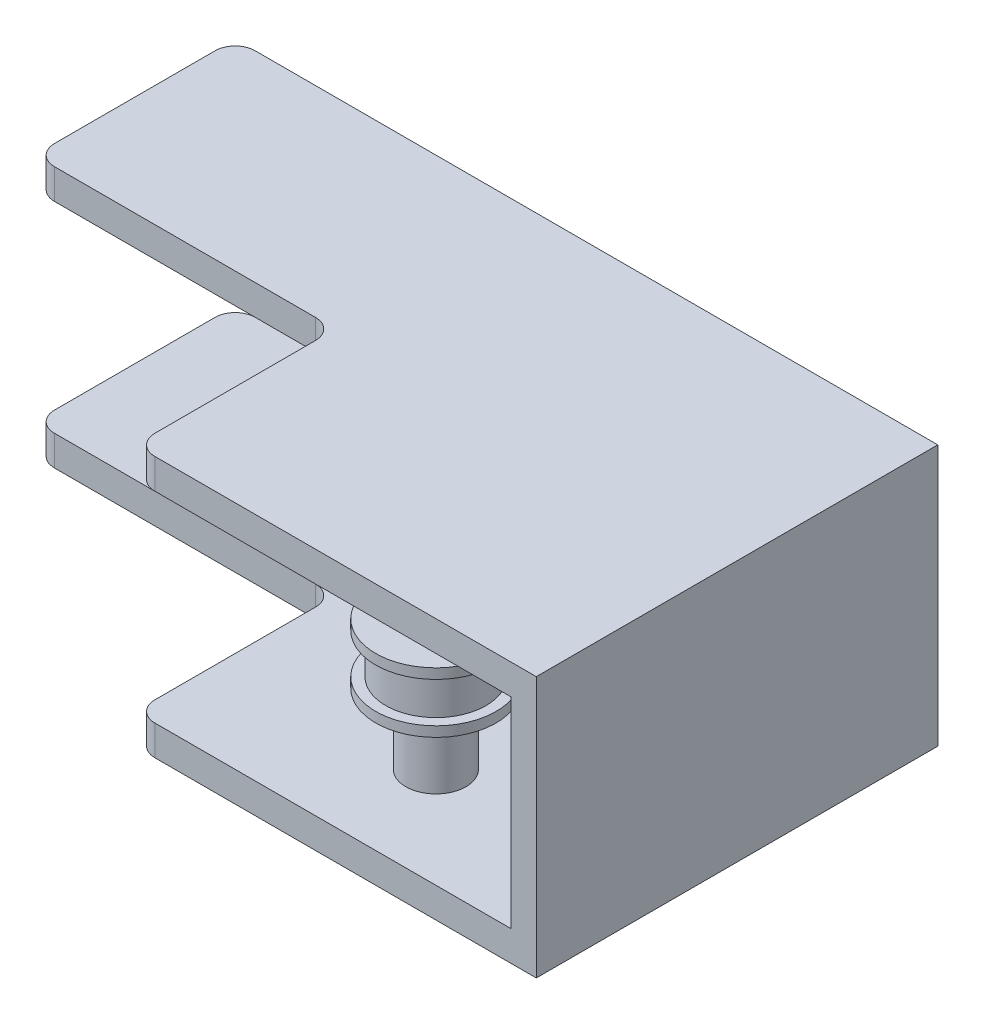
from build123d import *

# Parameters (mm, degrees)
EXTRUDE_1_DEPTH  = 3
SKETCH_2_R       = 3
EXTRUDE_2_DEPTH  = 7
SKETCH_3_R       = 6
EXTRUDE_4_DEPTH  = 1
SKETCH_4_R       = 5
EXTRUDE_5_DEPTH  = 4
SKETCH_5_R       = 6
EXTRUDE_6_DEPTH  = 1
SKETCH_6_R       = 3
EXTRUDE_7_DEPTH  = 7
SKETCH_13_W      = 2.5
SKETCH_13_H      = 40
EXTRUDE_19_DEPTH = 20
EXTRUDE_START    = 3
EXTRUDE_20_DEPTH = 3


with BuildPart() as part:
    # Sketch 1 → Extrude 1 (new body)
    with BuildSketch(Plane(origin=(0, 0, 0), x_dir=(1, 0, 0), z_dir=(0, 1, 0))):
        with BuildLine():
            Line((-22, 0), (-48, 0))
            ThreePointArc((-48, 0), (-49.414213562, 0.585786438), (-50, 2))
            Line((-50, 2), (-50, 18))
            ThreePointArc((-50, 18), (-49.414213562, 19.414213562), (-48, 20))
            Line((-48, 20), (-20, 20))
            Line((-20, 20), (18, 20))
            Line((18, 20), (20, 20))
            Line((20, 20), (20, 18))
            Line((20, 18), (20, -18))
            Line((20, -18), (20, -20))
            Line((20, -20), (18, -20))
            Line((18, -20), (-18, -20))
            ThreePointArc((-18, -20), (-19.414213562, -19.414213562), (-20, -18))
            Line((-20, -18), (-20, -2))
            ThreePointArc((-20, -2), (-20.585786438, -0.585786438), (-22, 0))
        make_face()
    extrude(amount=EXTRUDE_1_DEPTH)

    # Sketch 2 → Extrude 2 (add)
    with BuildSketch(Plane.XZ):
        with Locations(Location((0, 10, 0), (0, 0, 270))):
            Circle(SKETCH_2_R)
    extrude(amount=EXTRUDE_2_DEPTH)

    # Sketch 3 → Extrude 4 (add)
    with BuildSketch(Plane.XZ.offset(7)):
        with Locations(Location((0, 10, 0), (0, 0, 270))):
            Circle(SKETCH_3_R)
    extrude(amount=EXTRUDE_4_DEPTH)

    # Sketch 4 → Extrude 5 (add)
    with BuildSketch(Plane.XZ.offset(8)):
        with Locations(Location((0, 10, 0), (0, 0, 270))):
            Circle(SKETCH_4_R)
    extrude(amount=EXTRUDE_5_DEPTH)

    # Sketch 5 → Extrude 6 (add)
    with BuildSketch(Plane.XZ.offset(12)):
        with Locations(Location((0, 10, 0), (0, 0, 270))):
            Circle(SKETCH_5_R)
    extrude(amount=EXTRUDE_6_DEPTH)

    # Sketch 6 → Extrude 7 (add)
    with BuildSketch(Plane.XZ.offset(13)):
        with Locations(Location((0, 10, 0), (0, 0, 270))):
            Circle(SKETCH_6_R)
    extrude(amount=EXTRUDE_7_DEPTH)

    # Sketch 13 → Extrude 19 (add)
    with BuildSketch(Plane.XZ):
        with Locations((18.75, 0)):
            Rectangle(SKETCH_13_W, SKETCH_13_H)
    extrude(amount=EXTRUDE_19_DEPTH)

    # Sketch 15 → Extrude 20 (add)
    with BuildSketch(Plane.XZ.offset(20).offset(EXTRUDE_START)):
        with BuildLine():
            Line((-48, -20), (17.5, -20))
            Line((17.5, -20), (20, -20))
            Line((20, -20), (20, 20))
            Line((20, 20), (17.5, 20))
            Line((17.5, 20), (-18, 20))
            ThreePointArc((-18, 20), (-19.414213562, 19.414213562), (-20, 18))
            Line((-20, 18), (-20, 2))
            ThreePointArc((-20, 2), (-20.585786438, 0.585786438), (-22, 0))
            Line((-22, 0), (-48, 0))
            ThreePointArc((-48, 0), (-49.414213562, -0.585786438), (-50, -2))
            Line((-50, -2), (-50, -18))
            ThreePointArc((-50, -18), (-49.414213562, -19.414213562), (-48, -20))
        make_face()
    extrude(amount=-EXTRUDE_20_DEPTH)


solid = part.part
